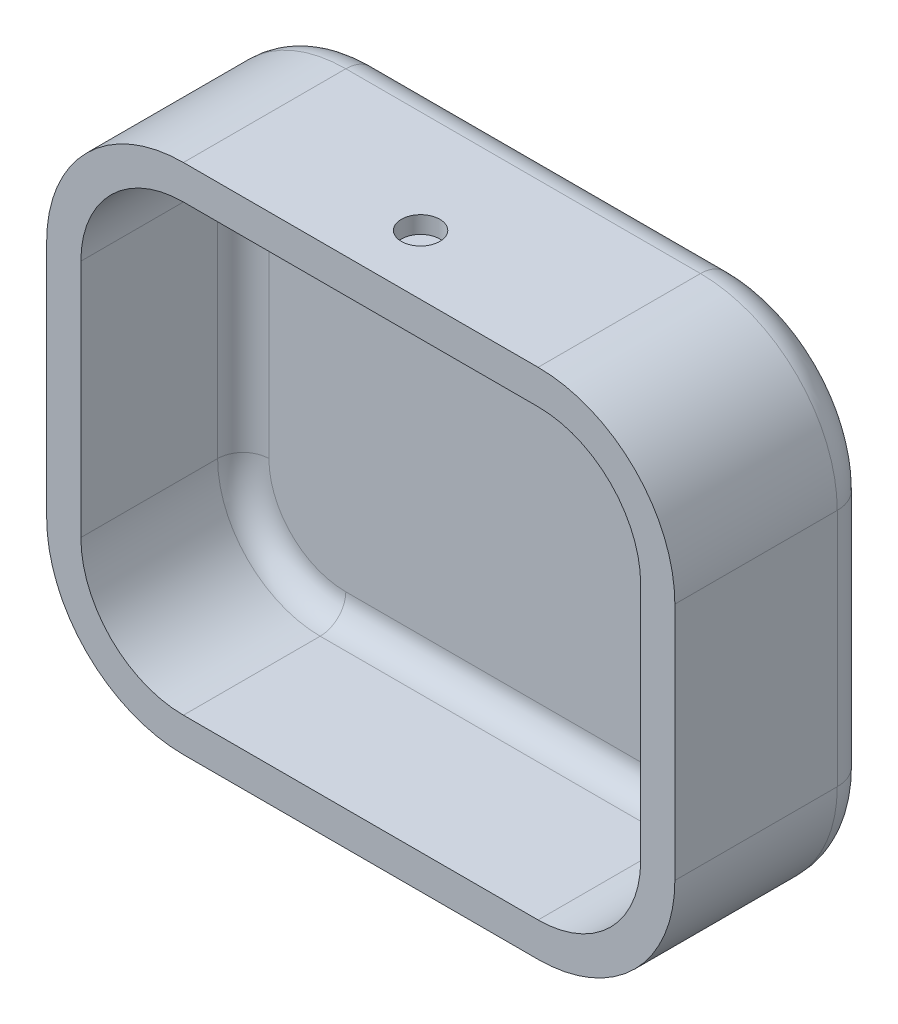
from build123d import *

# Parameters (mm, degrees)
BOSS_EXTRUDE1_DEPTH = 19
BOSS_EXTRUDE2_START = 4
BOSS_EXTRUDE2_DEPTH = 4
FILLET1_R           = 4
FILLET2_R           = 3
SKETCH9_R           = 2.25
CUT_EXTRUDE1_DEPTH  = 2
CUT_EXTRUDE2_START  = -2
SKETCH10_R          = 2.25
CUT_EXTRUDE2_DEPTH  = 2


with BuildPart() as part:
    # Sketch1 → Boss-Extrude1 (new body)
    with BuildSketch(Plane.XY):
        with BuildLine():
            Line((-4, 12), (-4, 40))
            ThreePointArc((-4, 40), (0.686291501, 51.313708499), (12, 56))
            Line((12, 56), (53.5, 56))
            ThreePointArc((53.5, 56), (64.813708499, 51.313708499), (69.5, 40))
            Line((69.5, 40), (69.5, 12))
            ThreePointArc((69.5, 12), (64.813708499, 0.686291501), (53.5, -4))
            Line((53.5, -4), (12, -4))
            ThreePointArc((12, -4), (0.686291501, 0.686291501), (-4, 12))
        make_face()
        with BuildLine():
            Line((0, 12), (0, 40))
            ThreePointArc((0, 40), (3.514718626, 48.485281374), (12, 52))
            Line((12, 52), (53.5, 52))
            ThreePointArc((53.5, 52), (61.985281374, 48.485281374), (65.5, 40))
            Line((65.5, 40), (65.5, 12))
            ThreePointArc((65.5, 12), (61.985281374, 3.514718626), (53.5, 0))
            Line((53.5, 0), (12, 0))
            ThreePointArc((12, 0), (3.514718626, 3.514718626), (0, 12))
        make_face(mode=Mode.SUBTRACT)
    extrude(amount=BOSS_EXTRUDE1_DEPTH)

    # Sketch7 → Boss-Extrude2 (add)
    with BuildSketch(Plane(origin=(0, 0, 0), x_dir=(-1, 0, 0), z_dir=(0, 0, -1)).offset(BOSS_EXTRUDE2_START)):
        with BuildLine():
            Line((-53.5, 56), (-12, 56))
            ThreePointArc((-12, 56), (-0.686291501, 51.313708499), (4, 40))
            Line((4, 40), (4, 12))
            ThreePointArc((4, 12), (-0.686291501, 0.686291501), (-12, -4))
            Line((-12, -4), (-53.5, -4))
            ThreePointArc((-53.5, -4), (-64.813708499, 0.686291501), (-69.5, 12))
            Line((-69.5, 12), (-69.5, 40))
            ThreePointArc((-69.5, 40), (-64.813708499, 51.313708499), (-53.5, 56))
        make_face()
    extrude(amount=-BOSS_EXTRUDE2_DEPTH)

    # Fillet1
    fillet1_edges = [part.edges().sort_by_distance(p)[0] for p in [
        (64.813708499, 51.313708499, -4),
        (69.5, 26, -4),
        (64.813708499, 0.686291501, -4),
        (32.75, -4, -4),
        (0.686291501, 0.686291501, -4),
        (-4, 26, -4),
        (0.686291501, 51.313708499, -4),
        (32.75, 56, -4),
    ]]
    fillet(fillet1_edges, radius=FILLET1_R)

    # Fillet2
    fillet2_edges = [part.edges().sort_by_distance(p)[0] for p in [
        (3.514718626, 3.514718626, 0),
        (32.75, 0, 0),
        (61.985281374, 3.514718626, 0),
        (65.5, 26, 0),
        (61.985281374, 48.485281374, 0),
        (32.75, 52, 0),
        (3.514718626, 48.485281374, 0),
        (0, 26, 0),
    ]]
    fillet(fillet2_edges, radius=FILLET2_R)

    # Sketch9 → Cut-Extrude1 (cut)
    with BuildSketch(Plane(origin=(0, 56, 0), x_dir=(1, 0, 0), z_dir=(0, 1, 0))):
        with Locations(Location((32.75, -12, 0), (0, 0, 270))):
            Circle(SKETCH9_R)
    extrude(amount=-CUT_EXTRUDE1_DEPTH, mode=Mode.SUBTRACT)

    # Sketch10 → Cut-Extrude2 (cut)
    with BuildSketch(Plane.XZ.offset(4).offset(CUT_EXTRUDE2_START)):
        with Locations(Location((32.75, 12, 0), (0, 0, 90))):
            Circle(SKETCH10_R)
    extrude(amount=CUT_EXTRUDE2_DEPTH, mode=Mode.SUBTRACT)


solid = part.part
